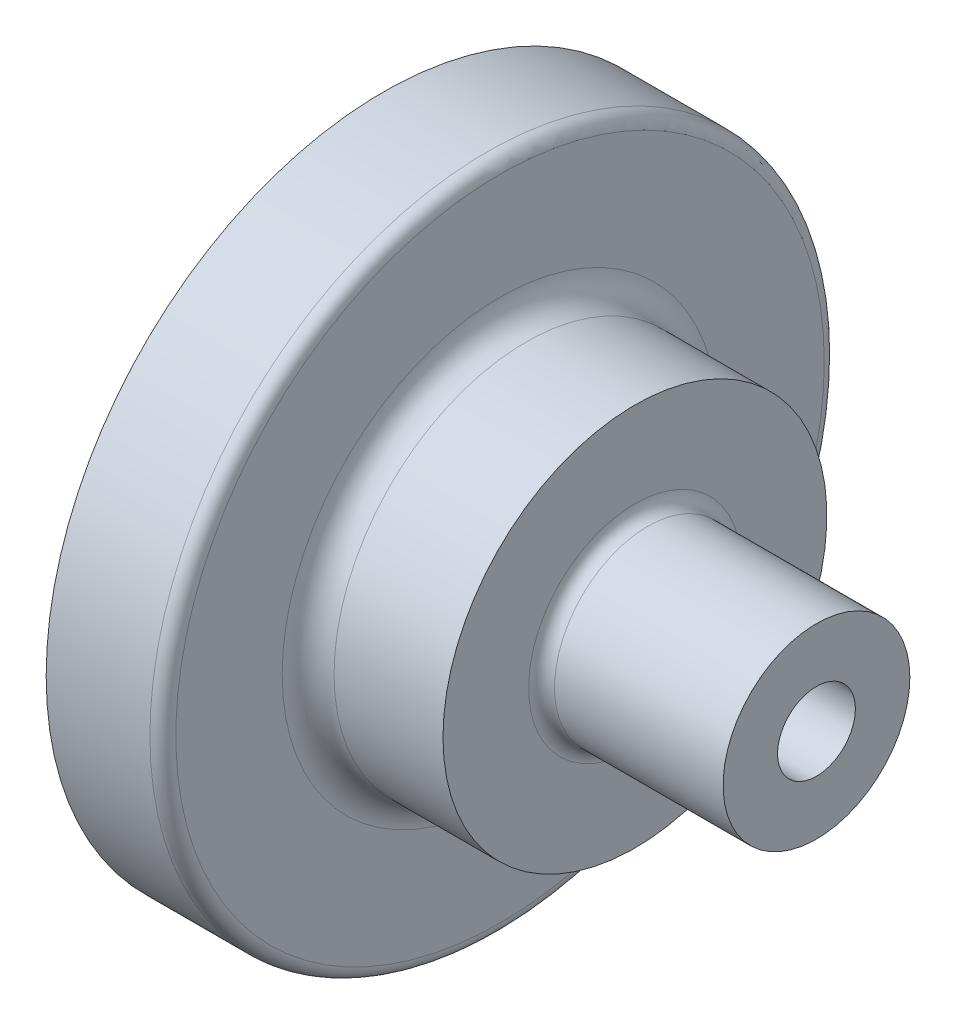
ISO-10303-21;
HEADER;
FILE_DESCRIPTION(('STEP AP214'),'2;1');
FILE_NAME('part.step','',(''),(''),'','','');
FILE_SCHEMA(('AUTOMOTIVE_DESIGN { 1 0 10303 214 1 1 1 1 }'));
ENDSEC;
DATA;
#1=APPLICATION_CONTEXT('core data for automotive mechanical design processes');
#2=APPLICATION_PROTOCOL_DEFINITION('international standard','automotive_design',2000,#1);
#3=PRODUCT_CONTEXT('',#1,'mechanical');
#4=PRODUCT('Part','Part','',(#3));
#5=PRODUCT_RELATED_PRODUCT_CATEGORY('part','',(#4));
#6=PRODUCT_DEFINITION_FORMATION('','',#4);
#7=PRODUCT_DEFINITION_CONTEXT('part definition',#1,'design');
#8=PRODUCT_DEFINITION('design','',#6,#7);
#9=PRODUCT_DEFINITION_SHAPE('','',#8);
#10=(LENGTH_UNIT() NAMED_UNIT(*) SI_UNIT(.MILLI.,.METRE.));
#11=(NAMED_UNIT(*) PLANE_ANGLE_UNIT() SI_UNIT($,.RADIAN.));
#12=(NAMED_UNIT(*) SI_UNIT($,.STERADIAN.) SOLID_ANGLE_UNIT());
#13=UNCERTAINTY_MEASURE_WITH_UNIT(LENGTH_MEASURE(1.E-05),#10,'distance_accuracy_value','');
#14=(GEOMETRIC_REPRESENTATION_CONTEXT(3) GLOBAL_UNCERTAINTY_ASSIGNED_CONTEXT((#13)) GLOBAL_UNIT_ASSIGNED_CONTEXT((#10,
#11,#12)) REPRESENTATION_CONTEXT('',''));
#15=CARTESIAN_POINT('',(0.,0.,0.));
#16=DIRECTION('',(0.,0.,1.));
#17=DIRECTION('',(1.,0.,0.));
#18=AXIS2_PLACEMENT_3D('',#15,#16,#17);
#19=CARTESIAN_POINT('',(45.,0.,0.));
#20=DIRECTION('',(-1.,0.,0.));
#21=DIRECTION('',(0.,0.,1.));
#22=AXIS2_PLACEMENT_3D('',#19,#20,#21);
#23=CYLINDRICAL_SURFACE('',#22,130.);
#24=CARTESIAN_POINT('',(40.,0.,0.));
#25=DIRECTION('',(1.,0.,0.));
#26=DIRECTION('',(0.,0.,-1.));
#27=AXIS2_PLACEMENT_3D('',#24,#25,#26);
#28=CIRCLE('',#27,130.);
#29=CARTESIAN_POINT('',(40.,0.,130.));
#30=VERTEX_POINT('',#29);
#31=EDGE_CURVE('E57',#30,#30,#28,.F.);
#32=CARTESIAN_POINT('',(0.,0.,0.));
#33=DIRECTION('',(1.,0.,0.));
#34=DIRECTION('',(0.,0.,-1.));
#35=AXIS2_PLACEMENT_3D('',#32,#33,#34);
#36=CIRCLE('',#35,130.);
#37=CARTESIAN_POINT('',(0.,0.,130.));
#38=VERTEX_POINT('',#37);
#39=EDGE_CURVE('E66',#38,#38,#36,.T.);
#40=CARTESIAN_POINT('',(40.,0.,130.));
#41=CARTESIAN_POINT('',(39.5833333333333,0.,130.));
#42=CARTESIAN_POINT('',(39.1666666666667,0.,130.));
#43=CARTESIAN_POINT('',(38.3333333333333,0.,130.));
#44=CARTESIAN_POINT('',(37.9166666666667,0.,130.));
#45=CARTESIAN_POINT('',(37.0833333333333,0.,130.));
#46=CARTESIAN_POINT('',(36.6666666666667,0.,130.));
#47=CARTESIAN_POINT('',(35.8333333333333,0.,130.));
#48=CARTESIAN_POINT('',(35.4166666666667,0.,130.));
#49=CARTESIAN_POINT('',(34.5833333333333,0.,130.));
#50=CARTESIAN_POINT('',(34.1666666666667,0.,130.));
#51=CARTESIAN_POINT('',(33.3333333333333,0.,130.));
#52=CARTESIAN_POINT('',(32.9166666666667,0.,130.));
#53=CARTESIAN_POINT('',(32.0833333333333,0.,130.));
#54=CARTESIAN_POINT('',(31.6666666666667,0.,130.));
#55=CARTESIAN_POINT('',(30.8333333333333,0.,130.));
#56=CARTESIAN_POINT('',(30.4166666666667,0.,130.));
#57=CARTESIAN_POINT('',(29.5833333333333,0.,130.));
#58=CARTESIAN_POINT('',(29.1666666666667,0.,130.));
#59=CARTESIAN_POINT('',(28.3333333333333,0.,130.));
#60=CARTESIAN_POINT('',(27.9166666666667,0.,130.));
#61=CARTESIAN_POINT('',(27.0833333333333,0.,130.));
#62=CARTESIAN_POINT('',(26.6666666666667,0.,130.));
#63=CARTESIAN_POINT('',(25.8333333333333,0.,130.));
#64=CARTESIAN_POINT('',(25.4166666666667,0.,130.));
#65=CARTESIAN_POINT('',(24.5833333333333,0.,130.));
#66=CARTESIAN_POINT('',(24.1666666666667,0.,130.));
#67=CARTESIAN_POINT('',(23.3333333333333,0.,130.));
#68=CARTESIAN_POINT('',(22.9166666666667,0.,130.));
#69=CARTESIAN_POINT('',(22.0833333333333,0.,130.));
#70=CARTESIAN_POINT('',(21.6666666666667,0.,130.));
#71=CARTESIAN_POINT('',(20.8333333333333,0.,130.));
#72=CARTESIAN_POINT('',(20.4166666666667,0.,130.));
#73=CARTESIAN_POINT('',(19.5833333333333,0.,130.));
#74=CARTESIAN_POINT('',(19.1666666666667,0.,130.));
#75=CARTESIAN_POINT('',(18.3333333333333,0.,130.));
#76=CARTESIAN_POINT('',(17.9166666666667,0.,130.));
#77=CARTESIAN_POINT('',(17.0833333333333,0.,130.));
#78=CARTESIAN_POINT('',(16.6666666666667,0.,130.));
#79=CARTESIAN_POINT('',(15.8333333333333,0.,130.));
#80=CARTESIAN_POINT('',(15.4166666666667,0.,130.));
#81=CARTESIAN_POINT('',(14.5833333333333,0.,130.));
#82=CARTESIAN_POINT('',(14.1666666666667,0.,130.));
#83=CARTESIAN_POINT('',(13.3333333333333,0.,130.));
#84=CARTESIAN_POINT('',(12.9166666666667,0.,130.));
#85=CARTESIAN_POINT('',(12.0833333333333,0.,130.));
#86=CARTESIAN_POINT('',(11.6666666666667,0.,130.));
#87=CARTESIAN_POINT('',(10.8333333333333,0.,130.));
#88=CARTESIAN_POINT('',(10.4166666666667,0.,130.));
#89=CARTESIAN_POINT('',(9.58333333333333,0.,130.));
#90=CARTESIAN_POINT('',(9.16666666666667,0.,130.));
#91=CARTESIAN_POINT('',(8.33333333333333,0.,130.));
#92=CARTESIAN_POINT('',(7.91666666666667,0.,130.));
#93=CARTESIAN_POINT('',(7.08333333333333,0.,130.));
#94=CARTESIAN_POINT('',(6.66666666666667,0.,130.));
#95=CARTESIAN_POINT('',(5.83333333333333,0.,130.));
#96=CARTESIAN_POINT('',(5.41666666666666,0.,130.));
#97=CARTESIAN_POINT('',(4.58333333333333,0.,130.));
#98=CARTESIAN_POINT('',(4.16666666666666,0.,130.));
#99=CARTESIAN_POINT('',(3.33333333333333,0.,130.));
#100=CARTESIAN_POINT('',(2.91666666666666,0.,130.));
#101=CARTESIAN_POINT('',(2.08333333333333,0.,130.));
#102=CARTESIAN_POINT('',(1.66666666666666,0.,130.));
#103=CARTESIAN_POINT('',(0.833333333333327,0.,130.));
#104=CARTESIAN_POINT('',(0.41666666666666,0.,130.));
#105=CARTESIAN_POINT('',(0.,0.,130.));
#106=B_SPLINE_CURVE_WITH_KNOTS('',3,(#40,#41,#42,#43,#44,#45,#46,#47,#48,#49,#50,#51,#52,#53,
#54,#55,#56,#57,#58,#59,#60,#61,#62,#63,#64,#65,#66,#67,#68,#69,#70,#71,#72,#73,#74,#75,#76,#77,
#78,#79,#80,#81,#82,#83,#84,#85,#86,#87,#88,#89,#90,#91,#92,#93,#94,#95,#96,#97,#98,#99,#100,
#101,#102,#103,#104,#105),.UNSPECIFIED.,.F.,.F.,(4,2,2,2,2,2,2,2,2,2,2,2,2,2,2,2,2,2,2,2,2,2,2,
2,2,2,2,2,2,2,2,2,4),(0.,1.25,2.5,3.75,5.,6.25000000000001,7.5,8.75,10.,11.25,12.5,13.75,15.,
16.25,17.5,18.75,20.,21.25,22.5,23.75,25.,26.25,27.5,28.75,30.,31.25,32.5,33.75,35.,36.25,37.5,
38.75,40.),.UNSPECIFIED.);
#107=EDGE_CURVE('BSEAM37',#30,#38,#106,.T.);
#108=ORIENTED_EDGE('',*,*,#31,.T.);
#109=ORIENTED_EDGE('',*,*,#39,.T.);
#110=ORIENTED_EDGE('',*,*,#107,.T.);
#111=ORIENTED_EDGE('',*,*,#107,.F.);
#112=EDGE_LOOP('',(#108,#110,#109,#111));
#113=FACE_BOUND('',#112,.T.);
#114=ADVANCED_FACE('F37',(#113),#23,.T.);
#115=CARTESIAN_POINT('',(45.,0.,0.));
#116=DIRECTION('',(1.,0.,0.));
#117=DIRECTION('',(0.,0.,-1.));
#118=AXIS2_PLACEMENT_3D('',#115,#116,#117);
#119=PLANE('',#118);
#120=CARTESIAN_POINT('',(45.,0.,0.));
#121=DIRECTION('',(1.,0.,0.));
#122=DIRECTION('',(0.,0.,-1.));
#123=AXIS2_PLACEMENT_3D('',#120,#121,#122);
#124=CIRCLE('',#123,84.);
#125=CARTESIAN_POINT('',(45.,0.,-84.));
#126=VERTEX_POINT('',#125);
#127=EDGE_CURVE('E48',#126,#126,#124,.F.);
#128=ORIENTED_EDGE('',*,*,#127,.T.);
#129=EDGE_LOOP('',(#128));
#130=FACE_BOUND('',#129,.T.);
#131=CARTESIAN_POINT('',(45.,0.,0.));
#132=DIRECTION('',(1.,0.,0.));
#133=DIRECTION('',(0.,0.,-1.));
#134=AXIS2_PLACEMENT_3D('',#131,#132,#133);
#135=CIRCLE('',#134,125.);
#136=CARTESIAN_POINT('',(45.,0.,-125.));
#137=VERTEX_POINT('',#136);
#138=EDGE_CURVE('E60',#137,#137,#135,.T.);
#139=ORIENTED_EDGE('',*,*,#138,.T.);
#140=EDGE_LOOP('',(#139));
#141=FACE_BOUND('',#140,.T.);
#142=ADVANCED_FACE('F111',(#130,#141),#119,.T.);
#143=CARTESIAN_POINT('',(0.,0.,0.));
#144=DIRECTION('',(1.,0.,0.));
#145=DIRECTION('',(0.,0.,-1.));
#146=AXIS2_PLACEMENT_3D('',#143,#144,#145);
#147=PLANE('',#146);
#148=CARTESIAN_POINT('',(0.,0.,0.));
#149=DIRECTION('',(1.,0.,0.));
#150=DIRECTION('',(0.,0.,-1.));
#151=AXIS2_PLACEMENT_3D('',#148,#149,#150);
#152=CIRCLE('',#151,98.);
#153=CARTESIAN_POINT('',(0.,0.,-98.));
#154=VERTEX_POINT('',#153);
#155=EDGE_CURVE('E63',#154,#154,#152,.F.);
#156=ORIENTED_EDGE('',*,*,#155,.F.);
#157=EDGE_LOOP('',(#156));
#158=FACE_BOUND('',#157,.T.);
#159=ORIENTED_EDGE('',*,*,#39,.F.);
#160=EDGE_LOOP('',(#159));
#161=FACE_BOUND('',#160,.T.);
#162=ADVANCED_FACE('F117',(#158,#161),#147,.F.);
#163=CARTESIAN_POINT('',(-6.,0.,0.));
#164=DIRECTION('',(-1.,0.,0.));
#165=DIRECTION('',(0.,0.,1.));
#166=AXIS2_PLACEMENT_3D('',#163,#164,#165);
#167=PLANE('',#166);
#168=CARTESIAN_POINT('',(-6.,0.,0.));
#169=DIRECTION('',(-1.,0.,0.));
#170=DIRECTION('',(0.,0.,1.));
#171=AXIS2_PLACEMENT_3D('',#168,#169,#170);
#172=CIRCLE('',#171,98.);
#173=CARTESIAN_POINT('',(-6.,0.,98.));
#174=VERTEX_POINT('',#173);
#175=EDGE_CURVE('E69',#174,#174,#172,.T.);
#176=ORIENTED_EDGE('',*,*,#175,.T.);
#177=EDGE_LOOP('',(#176));
#178=FACE_BOUND('',#177,.T.);
#179=CARTESIAN_POINT('',(-6.,0.,0.));
#180=DIRECTION('',(-1.,0.,0.));
#181=DIRECTION('',(0.,0.,1.));
#182=AXIS2_PLACEMENT_3D('',#179,#180,#181);
#183=CIRCLE('',#182,85.);
#184=CARTESIAN_POINT('',(-6.,0.,85.));
#185=VERTEX_POINT('',#184);
#186=EDGE_CURVE('E72',#185,#185,#183,.T.);
#187=ORIENTED_EDGE('',*,*,#186,.F.);
#188=EDGE_LOOP('',(#187));
#189=FACE_BOUND('',#188,.T.);
#190=ADVANCED_FACE('F148',(#178,#189),#167,.T.);
#191=CARTESIAN_POINT('',(-6.,0.,0.));
#192=DIRECTION('',(1.,0.,0.));
#193=DIRECTION('',(0.,0.,-1.));
#194=AXIS2_PLACEMENT_3D('',#191,#192,#193);
#195=CYLINDRICAL_SURFACE('',#194,98.);
#196=ORIENTED_EDGE('',*,*,#175,.F.);
#197=EDGE_LOOP('',(#196));
#198=FACE_BOUND('',#197,.T.);
#199=ORIENTED_EDGE('',*,*,#155,.T.);
#200=EDGE_LOOP('',(#199));
#201=FACE_BOUND('',#200,.T.);
#202=ADVANCED_FACE('F143',(#198,#201),#195,.T.);
#203=CARTESIAN_POINT('',(-6.,0.,0.));
#204=DIRECTION('',(1.,0.,0.));
#205=DIRECTION('',(0.,0.,-1.));
#206=AXIS2_PLACEMENT_3D('',#203,#204,#205);
#207=CYLINDRICAL_SURFACE('',#206,85.);
#208=ORIENTED_EDGE('',*,*,#186,.T.);
#209=EDGE_LOOP('',(#208));
#210=FACE_BOUND('',#209,.T.);
#211=CARTESIAN_POINT('',(0.,0.,0.));
#212=DIRECTION('',(-1.,0.,0.));
#213=DIRECTION('',(0.,0.,1.));
#214=AXIS2_PLACEMENT_3D('',#211,#212,#213);
#215=CIRCLE('',#214,85.);
#216=CARTESIAN_POINT('',(0.,0.,85.));
#217=VERTEX_POINT('',#216);
#218=EDGE_CURVE('E73',#217,#217,#215,.T.);
#219=ORIENTED_EDGE('',*,*,#218,.F.);
#220=EDGE_LOOP('',(#219));
#221=FACE_BOUND('',#220,.T.);
#222=ADVANCED_FACE('F134',(#210,#221),#207,.F.);
#223=CARTESIAN_POINT('',(0.,0.,0.));
#224=DIRECTION('',(1.,0.,0.));
#225=DIRECTION('',(0.,0.,-1.));
#226=AXIS2_PLACEMENT_3D('',#223,#224,#225);
#227=CIRCLE('',#226,15.);
#228=CARTESIAN_POINT('',(0.,0.,-15.));
#229=VERTEX_POINT('',#228);
#230=EDGE_CURVE('E84',#229,#229,#227,.T.);
#231=ORIENTED_EDGE('',*,*,#230,.T.);
#232=EDGE_LOOP('',(#231));
#233=FACE_BOUND('',#232,.T.);
#234=ORIENTED_EDGE('',*,*,#218,.T.);
#235=EDGE_LOOP('',(#234));
#236=FACE_BOUND('',#235,.T.);
#237=ADVANCED_FACE('F126',(#233,#236),#147,.F.);
#238=CARTESIAN_POINT('',(40.,0.,0.));
#239=DIRECTION('',(1.,0.,0.));
#240=DIRECTION('',(0.,0.,-1.));
#241=AXIS2_PLACEMENT_3D('',#238,#239,#240);
#242=TOROIDAL_SURFACE('',#241,125.,5.);
#243=ORIENTED_EDGE('',*,*,#31,.F.);
#244=EDGE_LOOP('',(#243));
#245=FACE_BOUND('',#244,.T.);
#246=ORIENTED_EDGE('',*,*,#138,.F.);
#247=EDGE_LOOP('',(#246));
#248=FACE_BOUND('',#247,.T.);
#249=ADVANCED_FACE('F123',(#245,#248),#242,.T.);
#250=CARTESIAN_POINT('',(97.,0.,0.));
#251=DIRECTION('',(-1.,0.,0.));
#252=DIRECTION('',(0.,0.,1.));
#253=AXIS2_PLACEMENT_3D('',#250,#251,#252);
#254=CYLINDRICAL_SURFACE('',#253,74.);
#255=CARTESIAN_POINT('',(55.,0.,0.));
#256=DIRECTION('',(1.,0.,0.));
#257=DIRECTION('',(0.,0.,-1.));
#258=AXIS2_PLACEMENT_3D('',#255,#256,#257);
#259=CIRCLE('',#258,74.);
#260=CARTESIAN_POINT('',(55.,0.,74.));
#261=VERTEX_POINT('',#260);
#262=EDGE_CURVE('E52',#261,#261,#259,.T.);
#263=CARTESIAN_POINT('',(97.,0.,0.));
#264=DIRECTION('',(1.,0.,0.));
#265=DIRECTION('',(0.,0.,-1.));
#266=AXIS2_PLACEMENT_3D('',#263,#264,#265);
#267=CIRCLE('',#266,74.);
#268=CARTESIAN_POINT('',(97.,0.,74.));
#269=VERTEX_POINT('',#268);
#270=EDGE_CURVE('E76',#269,#269,#267,.T.);
#271=CARTESIAN_POINT('',(55.,0.,74.));
#272=CARTESIAN_POINT('',(55.4375,0.,74.));
#273=CARTESIAN_POINT('',(55.875,0.,74.));
#274=CARTESIAN_POINT('',(56.75,0.,74.));
#275=CARTESIAN_POINT('',(57.1875,0.,74.));
#276=CARTESIAN_POINT('',(58.0625,0.,74.));
#277=CARTESIAN_POINT('',(58.5,0.,74.));
#278=CARTESIAN_POINT('',(59.375,0.,74.));
#279=CARTESIAN_POINT('',(59.8125,0.,74.));
#280=CARTESIAN_POINT('',(60.6875,0.,74.));
#281=CARTESIAN_POINT('',(61.125,0.,74.));
#282=CARTESIAN_POINT('',(62.,0.,74.));
#283=CARTESIAN_POINT('',(62.4375,0.,74.));
#284=CARTESIAN_POINT('',(63.3125,0.,74.));
#285=CARTESIAN_POINT('',(63.75,0.,74.));
#286=CARTESIAN_POINT('',(64.625,0.,74.));
#287=CARTESIAN_POINT('',(65.0625,0.,74.));
#288=CARTESIAN_POINT('',(65.9375,0.,74.));
#289=CARTESIAN_POINT('',(66.375,0.,74.));
#290=CARTESIAN_POINT('',(67.25,0.,74.));
#291=CARTESIAN_POINT('',(67.6875,0.,74.));
#292=CARTESIAN_POINT('',(68.5625,0.,74.));
#293=CARTESIAN_POINT('',(69.,0.,74.));
#294=CARTESIAN_POINT('',(69.875,0.,74.));
#295=CARTESIAN_POINT('',(70.3125,0.,74.));
#296=CARTESIAN_POINT('',(71.1875,0.,74.));
#297=CARTESIAN_POINT('',(71.625,0.,74.));
#298=CARTESIAN_POINT('',(72.5,0.,74.));
#299=CARTESIAN_POINT('',(72.9375,0.,74.));
#300=CARTESIAN_POINT('',(73.8125,0.,74.));
#301=CARTESIAN_POINT('',(74.25,0.,74.));
#302=CARTESIAN_POINT('',(75.125,0.,74.));
#303=CARTESIAN_POINT('',(75.5625,0.,74.));
#304=CARTESIAN_POINT('',(76.4375,0.,74.));
#305=CARTESIAN_POINT('',(76.875,0.,74.));
#306=CARTESIAN_POINT('',(77.75,0.,74.));
#307=CARTESIAN_POINT('',(78.1875,0.,74.));
#308=CARTESIAN_POINT('',(79.0625,0.,74.));
#309=CARTESIAN_POINT('',(79.5,0.,74.));
#310=CARTESIAN_POINT('',(80.375,0.,74.));
#311=CARTESIAN_POINT('',(80.8125,0.,74.));
#312=CARTESIAN_POINT('',(81.6875,0.,74.));
#313=CARTESIAN_POINT('',(82.125,0.,74.));
#314=CARTESIAN_POINT('',(83.,0.,74.));
#315=CARTESIAN_POINT('',(83.4375,0.,74.));
#316=CARTESIAN_POINT('',(84.3125,0.,74.));
#317=CARTESIAN_POINT('',(84.75,0.,74.));
#318=CARTESIAN_POINT('',(85.625,0.,74.));
#319=CARTESIAN_POINT('',(86.0625,0.,74.));
#320=CARTESIAN_POINT('',(86.9375,0.,74.));
#321=CARTESIAN_POINT('',(87.375,0.,74.));
#322=CARTESIAN_POINT('',(88.25,0.,74.));
#323=CARTESIAN_POINT('',(88.6875,0.,74.));
#324=CARTESIAN_POINT('',(89.5625,0.,74.));
#325=CARTESIAN_POINT('',(90.,0.,74.));
#326=CARTESIAN_POINT('',(90.875,0.,74.));
#327=CARTESIAN_POINT('',(91.3125,0.,74.));
#328=CARTESIAN_POINT('',(92.1875,0.,74.));
#329=CARTESIAN_POINT('',(92.625,0.,74.));
#330=CARTESIAN_POINT('',(93.5,0.,74.));
#331=CARTESIAN_POINT('',(93.9375,0.,74.));
#332=CARTESIAN_POINT('',(94.8125,0.,74.));
#333=CARTESIAN_POINT('',(95.25,0.,74.));
#334=CARTESIAN_POINT('',(96.125,0.,74.));
#335=CARTESIAN_POINT('',(96.5625,0.,74.));
#336=CARTESIAN_POINT('',(97.,0.,74.));
#337=B_SPLINE_CURVE_WITH_KNOTS('',3,(#271,#272,#273,#274,#275,#276,#277,#278,#279,#280,#281,
#282,#283,#284,#285,#286,#287,#288,#289,#290,#291,#292,#293,#294,#295,#296,#297,#298,#299,#300,
#301,#302,#303,#304,#305,#306,#307,#308,#309,#310,#311,#312,#313,#314,#315,#316,#317,#318,#319,
#320,#321,#322,#323,#324,#325,#326,#327,#328,#329,#330,#331,#332,#333,#334,#335,#336),
.UNSPECIFIED.,.F.,.F.,(4,2,2,2,2,2,2,2,2,2,2,2,2,2,2,2,2,2,2,2,2,2,2,2,2,2,2,2,2,2,2,2,4),(0.,
1.3125,2.625,3.9375,5.25,6.5625,7.875,9.18750000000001,10.5,11.8125,13.125,14.4375,15.75,
17.0625,18.375,19.6875,21.,22.3125,23.625,24.9375,26.25,27.5625,28.875,30.1875,31.5,32.8125,
34.125,35.4375,36.75,38.0625,39.375,40.6875,42.),.UNSPECIFIED.);
#338=EDGE_CURVE('BSEAM125',#261,#269,#337,.T.);
#339=ORIENTED_EDGE('',*,*,#262,.T.);
#340=ORIENTED_EDGE('',*,*,#270,.F.);
#341=ORIENTED_EDGE('',*,*,#338,.T.);
#342=ORIENTED_EDGE('',*,*,#338,.F.);
#343=EDGE_LOOP('',(#339,#341,#340,#342));
#344=FACE_BOUND('',#343,.T.);
#345=ADVANCED_FACE('F125',(#344),#254,.T.);
#346=CARTESIAN_POINT('',(97.,0.,0.));
#347=DIRECTION('',(1.,0.,0.));
#348=DIRECTION('',(0.,0.,-1.));
#349=AXIS2_PLACEMENT_3D('',#346,#347,#348);
#350=PLANE('',#349);
#351=CARTESIAN_POINT('',(97.,0.,0.));
#352=DIRECTION('',(1.,0.,0.));
#353=DIRECTION('',(0.,0.,-1.));
#354=AXIS2_PLACEMENT_3D('',#351,#352,#353);
#355=CIRCLE('',#354,41.);
#356=CARTESIAN_POINT('',(97.,0.,-41.));
#357=VERTEX_POINT('',#356);
#358=EDGE_CURVE('E10',#357,#357,#355,.F.);
#359=ORIENTED_EDGE('',*,*,#358,.T.);
#360=EDGE_LOOP('',(#359));
#361=FACE_BOUND('',#360,.T.);
#362=ORIENTED_EDGE('',*,*,#270,.T.);
#363=EDGE_LOOP('',(#362));
#364=FACE_BOUND('',#363,.T.);
#365=ADVANCED_FACE('F107',(#361,#364),#350,.T.);
#366=CARTESIAN_POINT('',(55.,0.,0.));
#367=DIRECTION('',(1.,0.,0.));
#368=DIRECTION('',(0.,0.,-1.));
#369=AXIS2_PLACEMENT_3D('',#366,#367,#368);
#370=TOROIDAL_SURFACE('',#369,84.,10.);
#371=ORIENTED_EDGE('',*,*,#127,.F.);
#372=EDGE_LOOP('',(#371));
#373=FACE_BOUND('',#372,.T.);
#374=ORIENTED_EDGE('',*,*,#262,.F.);
#375=EDGE_LOOP('',(#374));
#376=FACE_BOUND('',#375,.T.);
#377=ADVANCED_FACE('F102',(#373,#376),#370,.F.);
#378=CARTESIAN_POINT('',(167.,0.,0.));
#379=DIRECTION('',(-1.,0.,0.));
#380=DIRECTION('',(0.,0.,1.));
#381=AXIS2_PLACEMENT_3D('',#378,#379,#380);
#382=CYLINDRICAL_SURFACE('',#381,36.);
#383=CARTESIAN_POINT('',(102.,0.,0.));
#384=DIRECTION('',(1.,0.,0.));
#385=DIRECTION('',(0.,0.,-1.));
#386=AXIS2_PLACEMENT_3D('',#383,#384,#385);
#387=CIRCLE('',#386,36.);
#388=CARTESIAN_POINT('',(102.,0.,-36.));
#389=VERTEX_POINT('',#388);
#390=EDGE_CURVE('E44',#389,#389,#387,.T.);
#391=ORIENTED_EDGE('',*,*,#390,.T.);
#392=EDGE_LOOP('',(#391));
#393=FACE_BOUND('',#392,.T.);
#394=CARTESIAN_POINT('',(167.,0.,0.));
#395=DIRECTION('',(1.,0.,0.));
#396=DIRECTION('',(0.,0.,-1.));
#397=AXIS2_PLACEMENT_3D('',#394,#395,#396);
#398=CIRCLE('',#397,36.);
#399=CARTESIAN_POINT('',(167.,0.,-36.));
#400=VERTEX_POINT('',#399);
#401=EDGE_CURVE('E81',#400,#400,#398,.T.);
#402=ORIENTED_EDGE('',*,*,#401,.F.);
#403=EDGE_LOOP('',(#402));
#404=FACE_BOUND('',#403,.T.);
#405=ADVANCED_FACE('F97',(#393,#404),#382,.T.);
#406=CARTESIAN_POINT('',(167.,0.,0.));
#407=DIRECTION('',(1.,0.,0.));
#408=DIRECTION('',(0.,0.,-1.));
#409=AXIS2_PLACEMENT_3D('',#406,#407,#408);
#410=PLANE('',#409);
#411=CARTESIAN_POINT('',(167.,0.,0.));
#412=DIRECTION('',(1.,0.,0.));
#413=DIRECTION('',(0.,0.,-1.));
#414=AXIS2_PLACEMENT_3D('',#411,#412,#413);
#415=CIRCLE('',#414,15.);
#416=CARTESIAN_POINT('',(167.,0.,-15.));
#417=VERTEX_POINT('',#416);
#418=EDGE_CURVE('E87',#417,#417,#415,.T.);
#419=ORIENTED_EDGE('',*,*,#418,.F.);
#420=EDGE_LOOP('',(#419));
#421=FACE_BOUND('',#420,.T.);
#422=ORIENTED_EDGE('',*,*,#401,.T.);
#423=EDGE_LOOP('',(#422));
#424=FACE_BOUND('',#423,.T.);
#425=ADVANCED_FACE('F94',(#421,#424),#410,.T.);
#426=CARTESIAN_POINT('',(102.,0.,0.));
#427=DIRECTION('',(1.,0.,0.));
#428=DIRECTION('',(0.,0.,-1.));
#429=AXIS2_PLACEMENT_3D('',#426,#427,#428);
#430=TOROIDAL_SURFACE('',#429,41.,5.);
#431=ORIENTED_EDGE('',*,*,#358,.F.);
#432=EDGE_LOOP('',(#431));
#433=FACE_BOUND('',#432,.T.);
#434=ORIENTED_EDGE('',*,*,#390,.F.);
#435=EDGE_LOOP('',(#434));
#436=FACE_BOUND('',#435,.T.);
#437=ADVANCED_FACE('F39',(#433,#436),#430,.F.);
#438=CARTESIAN_POINT('',(-6.00000000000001,0.,0.));
#439=DIRECTION('',(1.,0.,0.));
#440=DIRECTION('',(0.,0.,-1.));
#441=AXIS2_PLACEMENT_3D('',#438,#439,#440);
#442=CYLINDRICAL_SURFACE('',#441,15.);
#443=ORIENTED_EDGE('',*,*,#418,.T.);
#444=EDGE_LOOP('',(#443));
#445=FACE_BOUND('',#444,.T.);
#446=ORIENTED_EDGE('',*,*,#230,.F.);
#447=EDGE_LOOP('',(#446));
#448=FACE_BOUND('',#447,.T.);
#449=ADVANCED_FACE('F91',(#445,#448),#442,.F.);
#450=CLOSED_SHELL('',(#114,#142,#162,#190,#202,#222,#237,#249,#345,#365,#377,#405,#425,#437,#449));
#451=MANIFOLD_SOLID_BREP('B2',#450);
#452=ADVANCED_BREP_SHAPE_REPRESENTATION('',(#18,#451),#14);
#453=SHAPE_DEFINITION_REPRESENTATION(#9,#452);
ENDSEC;
END-ISO-10303-21;
